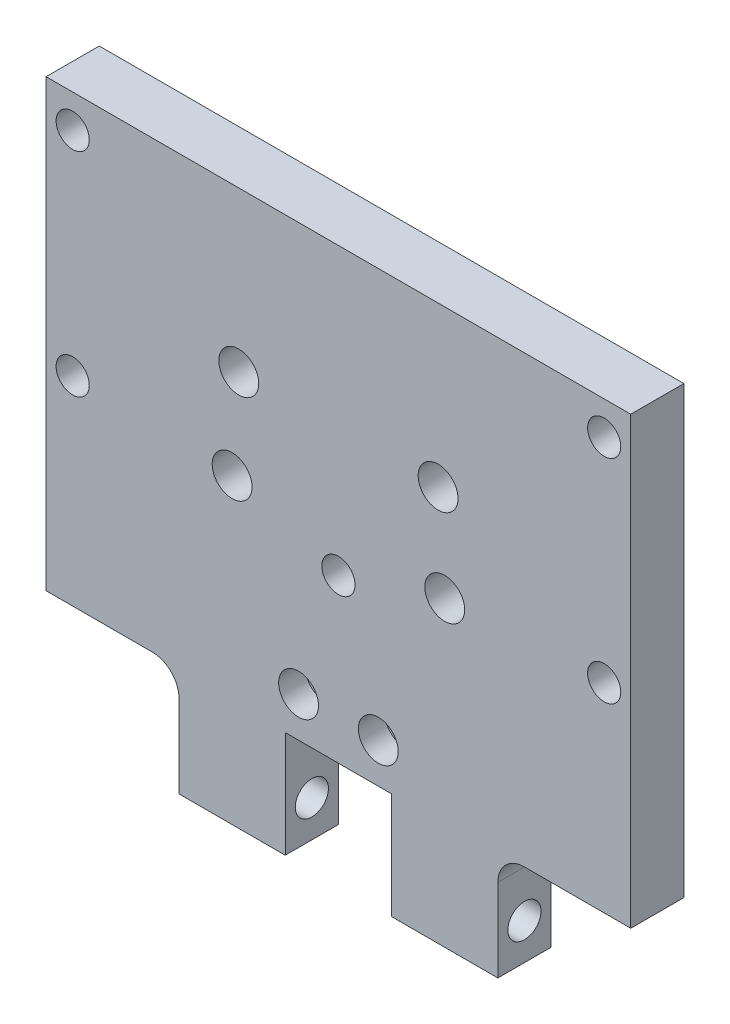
ISO-10303-21;
HEADER;
FILE_DESCRIPTION(('STEP AP214'),'2;1');
FILE_NAME('part.step','',(''),(''),'','','');
FILE_SCHEMA(('AUTOMOTIVE_DESIGN { 1 0 10303 214 1 1 1 1 }'));
ENDSEC;
DATA;
#1=APPLICATION_CONTEXT('core data for automotive mechanical design processes');
#2=APPLICATION_PROTOCOL_DEFINITION('international standard','automotive_design',2000,#1);
#3=PRODUCT_CONTEXT('',#1,'mechanical');
#4=PRODUCT('Part','Part','',(#3));
#5=PRODUCT_RELATED_PRODUCT_CATEGORY('part','',(#4));
#6=PRODUCT_DEFINITION_FORMATION('','',#4);
#7=PRODUCT_DEFINITION_CONTEXT('part definition',#1,'design');
#8=PRODUCT_DEFINITION('design','',#6,#7);
#9=PRODUCT_DEFINITION_SHAPE('','',#8);
#10=(LENGTH_UNIT() NAMED_UNIT(*) SI_UNIT(.MILLI.,.METRE.));
#11=(NAMED_UNIT(*) PLANE_ANGLE_UNIT() SI_UNIT($,.RADIAN.));
#12=(NAMED_UNIT(*) SI_UNIT($,.STERADIAN.) SOLID_ANGLE_UNIT());
#13=UNCERTAINTY_MEASURE_WITH_UNIT(LENGTH_MEASURE(1.E-05),#10,'distance_accuracy_value','');
#14=(GEOMETRIC_REPRESENTATION_CONTEXT(3) GLOBAL_UNCERTAINTY_ASSIGNED_CONTEXT((#13)) GLOBAL_UNIT_ASSIGNED_CONTEXT((#10,
#11,#12)) REPRESENTATION_CONTEXT('',''));
#15=CARTESIAN_POINT('',(0.,0.,0.));
#16=DIRECTION('',(0.,0.,1.));
#17=DIRECTION('',(1.,0.,0.));
#18=AXIS2_PLACEMENT_3D('',#15,#16,#17);
#19=CARTESIAN_POINT('',(0.,0.,6.35));
#20=DIRECTION('',(0.,0.,1.));
#21=DIRECTION('',(1.,0.,0.));
#22=AXIS2_PLACEMENT_3D('',#19,#20,#21);
#23=PLANE('',#22);
#24=CARTESIAN_POINT('',(-9.525,-59.5122,6.35));
#25=DIRECTION('',(0.,0.,1.));
#26=DIRECTION('',(1.,0.,0.));
#27=AXIS2_PLACEMENT_3D('',#24,#25,#26);
#28=CIRCLE('',#27,4.7625);
#29=CARTESIAN_POINT('',(-14.2875,-59.5122,6.35));
#30=VERTEX_POINT('',#29);
#31=EDGE_CURVE('E242',#30,#30,#28,.F.);
#32=ORIENTED_EDGE('',*,*,#31,.T.);
#33=EDGE_LOOP('',(#32));
#34=FACE_BOUND('',#33,.T.);
#35=CARTESIAN_POINT('',(0.,-30.1752,6.35));
#36=DIRECTION('',(0.,0.,1.));
#37=DIRECTION('',(1.,0.,0.));
#38=AXIS2_PLACEMENT_3D('',#35,#36,#37);
#39=CIRCLE('',#38,3.9624);
#40=CARTESIAN_POINT('',(3.9624,-30.1752,6.35));
#41=VERTEX_POINT('',#40);
#42=EDGE_CURVE('E288',#41,#41,#39,.T.);
#43=ORIENTED_EDGE('',*,*,#42,.F.);
#44=EDGE_LOOP('',(#43));
#45=FACE_BOUND('',#44,.T.);
#46=CARTESIAN_POINT('',(25.4,-22.225,6.35));
#47=DIRECTION('',(0.,0.,1.));
#48=DIRECTION('',(1.,0.,0.));
#49=AXIS2_PLACEMENT_3D('',#46,#47,#48);
#50=CIRCLE('',#49,4.7625);
#51=CARTESIAN_POINT('',(30.1625,-22.225,6.35));
#52=VERTEX_POINT('',#51);
#53=EDGE_CURVE('E292',#52,#52,#50,.T.);
#54=ORIENTED_EDGE('',*,*,#53,.F.);
#55=EDGE_LOOP('',(#54));
#56=FACE_BOUND('',#55,.T.);
#57=CARTESIAN_POINT('',(-25.4,-22.225,6.35));
#58=DIRECTION('',(0.,0.,1.));
#59=DIRECTION('',(1.,0.,0.));
#60=AXIS2_PLACEMENT_3D('',#57,#58,#59);
#61=CIRCLE('',#60,4.7625);
#62=CARTESIAN_POINT('',(-20.6375,-22.225,6.35));
#63=VERTEX_POINT('',#62);
#64=EDGE_CURVE('E298',#63,#63,#61,.T.);
#65=ORIENTED_EDGE('',*,*,#64,.F.);
#66=EDGE_LOOP('',(#65));
#67=FACE_BOUND('',#66,.T.);
#68=CARTESIAN_POINT('',(63.5,30.1752,6.35));
#69=DIRECTION('',(0.,0.,1.));
#70=DIRECTION('',(1.,0.,0.));
#71=AXIS2_PLACEMENT_3D('',#68,#69,#70);
#72=CIRCLE('',#71,3.96239999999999);
#73=CARTESIAN_POINT('',(67.4624,30.1752,6.35));
#74=VERTEX_POINT('',#73);
#75=EDGE_CURVE('E304',#74,#74,#72,.T.);
#76=ORIENTED_EDGE('',*,*,#75,.F.);
#77=EDGE_LOOP('',(#76));
#78=FACE_BOUND('',#77,.T.);
#79=CARTESIAN_POINT('',(63.5,-20.6248,6.35));
#80=DIRECTION('',(0.,0.,1.));
#81=DIRECTION('',(1.,0.,0.));
#82=AXIS2_PLACEMENT_3D('',#79,#80,#81);
#83=CIRCLE('',#82,3.96239999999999);
#84=CARTESIAN_POINT('',(67.4624,-20.6248,6.35));
#85=VERTEX_POINT('',#84);
#86=EDGE_CURVE('E310',#85,#85,#83,.T.);
#87=ORIENTED_EDGE('',*,*,#86,.F.);
#88=EDGE_LOOP('',(#87));
#89=FACE_BOUND('',#88,.T.);
#90=CARTESIAN_POINT('',(-63.5,30.1752,6.35));
#91=DIRECTION('',(0.,0.,1.));
#92=DIRECTION('',(1.,0.,0.));
#93=AXIS2_PLACEMENT_3D('',#90,#91,#92);
#94=CIRCLE('',#93,3.9624);
#95=CARTESIAN_POINT('',(-59.5376,30.1752,6.35));
#96=VERTEX_POINT('',#95);
#97=EDGE_CURVE('E316',#96,#96,#94,.T.);
#98=ORIENTED_EDGE('',*,*,#97,.F.);
#99=EDGE_LOOP('',(#98));
#100=FACE_BOUND('',#99,.T.);
#101=CARTESIAN_POINT('',(-63.5,-20.6248,6.35));
#102=DIRECTION('',(0.,0.,1.));
#103=DIRECTION('',(1.,0.,0.));
#104=AXIS2_PLACEMENT_3D('',#101,#102,#103);
#105=CIRCLE('',#104,3.9624);
#106=CARTESIAN_POINT('',(-59.5376,-20.6248,6.35));
#107=VERTEX_POINT('',#106);
#108=EDGE_CURVE('E322',#107,#107,#105,.T.);
#109=ORIENTED_EDGE('',*,*,#108,.F.);
#110=EDGE_LOOP('',(#109));
#111=FACE_BOUND('',#110,.T.);
#112=CARTESIAN_POINT('',(23.8125,0.,6.35));
#113=DIRECTION('',(0.,0.,1.));
#114=DIRECTION('',(1.,0.,0.));
#115=AXIS2_PLACEMENT_3D('',#112,#113,#114);
#116=CIRCLE('',#115,4.7625);
#117=CARTESIAN_POINT('',(28.575,0.,6.35));
#118=VERTEX_POINT('',#117);
#119=EDGE_CURVE('E328',#118,#118,#116,.T.);
#120=ORIENTED_EDGE('',*,*,#119,.F.);
#121=EDGE_LOOP('',(#120));
#122=FACE_BOUND('',#121,.T.);
#123=CARTESIAN_POINT('',(-23.8125,0.,6.35));
#124=DIRECTION('',(0.,0.,1.));
#125=DIRECTION('',(1.,0.,0.));
#126=AXIS2_PLACEMENT_3D('',#123,#124,#125);
#127=CIRCLE('',#126,4.7625);
#128=CARTESIAN_POINT('',(-19.05,0.,6.35));
#129=VERTEX_POINT('',#128);
#130=EDGE_CURVE('E165',#129,#129,#127,.T.);
#131=ORIENTED_EDGE('',*,*,#130,.F.);
#132=EDGE_LOOP('',(#131));
#133=FACE_BOUND('',#132,.T.);
#134=DIRECTION('',(0.,-1.,0.));
#135=VECTOR('',#134,1.);
#136=CARTESIAN_POINT('',(12.7,-94.4372,6.35));
#137=LINE('',#136,#135);
#138=CARTESIAN_POINT('',(12.7,-69.0372,6.35));
#139=VERTEX_POINT('',#138);
#140=CARTESIAN_POINT('',(12.7,-94.4372,6.35));
#141=VERTEX_POINT('',#140);
#142=EDGE_CURVE('E192',#139,#141,#137,.T.);
#143=ORIENTED_EDGE('',*,*,#142,.T.);
#144=DIRECTION('',(1.,0.,0.));
#145=VECTOR('',#144,1.);
#146=CARTESIAN_POINT('',(12.7,-94.4372,6.35));
#147=LINE('',#146,#145);
#148=CARTESIAN_POINT('',(38.1,-94.4372,6.35));
#149=VERTEX_POINT('',#148);
#150=EDGE_CURVE('E139',#141,#149,#147,.T.);
#151=ORIENTED_EDGE('',*,*,#150,.T.);
#152=DIRECTION('',(0.,1.,0.));
#153=VECTOR('',#152,1.);
#154=CARTESIAN_POINT('',(38.1,-94.4372,6.35));
#155=LINE('',#154,#153);
#156=CARTESIAN_POINT('',(38.1,-74.6252,6.35));
#157=VERTEX_POINT('',#156);
#158=EDGE_CURVE('E196',#149,#157,#155,.T.);
#159=ORIENTED_EDGE('',*,*,#158,.T.);
#160=CARTESIAN_POINT('',(44.45,-74.6252,6.35));
#161=DIRECTION('',(0.,0.,1.));
#162=DIRECTION('',(1.,0.,0.));
#163=AXIS2_PLACEMENT_3D('',#160,#161,#162);
#164=CIRCLE('',#163,6.35);
#165=CARTESIAN_POINT('',(44.45,-68.2752,6.35));
#166=VERTEX_POINT('',#165);
#167=EDGE_CURVE('E251',#157,#166,#164,.F.);
#168=ORIENTED_EDGE('',*,*,#167,.T.);
#169=DIRECTION('',(1.,0.,0.));
#170=VECTOR('',#169,1.);
#171=CARTESIAN_POINT('',(38.1,-68.2752,6.35));
#172=LINE('',#171,#170);
#173=CARTESIAN_POINT('',(69.85,-68.2752,6.35));
#174=VERTEX_POINT('',#173);
#175=EDGE_CURVE('E199',#166,#174,#172,.T.);
#176=ORIENTED_EDGE('',*,*,#175,.T.);
#177=DIRECTION('',(0.,1.,0.));
#178=VECTOR('',#177,1.);
#179=CARTESIAN_POINT('',(69.85,-68.2752,6.35));
#180=LINE('',#179,#178);
#181=CARTESIAN_POINT('',(69.85,38.1,6.35));
#182=VERTEX_POINT('',#181);
#183=EDGE_CURVE('E201',#174,#182,#180,.T.);
#184=ORIENTED_EDGE('',*,*,#183,.T.);
#185=DIRECTION('',(-1.,0.,0.));
#186=VECTOR('',#185,1.);
#187=CARTESIAN_POINT('',(69.85,38.1,6.35));
#188=LINE('',#187,#186);
#189=CARTESIAN_POINT('',(-69.85,38.1,6.35));
#190=VERTEX_POINT('',#189);
#191=EDGE_CURVE('E204',#182,#190,#188,.T.);
#192=ORIENTED_EDGE('',*,*,#191,.T.);
#193=DIRECTION('',(0.,-1.,0.));
#194=VECTOR('',#193,1.);
#195=CARTESIAN_POINT('',(-69.85,38.1,6.35));
#196=LINE('',#195,#194);
#197=CARTESIAN_POINT('',(-69.85,-68.2752,6.35));
#198=VERTEX_POINT('',#197);
#199=EDGE_CURVE('E207',#190,#198,#196,.T.);
#200=ORIENTED_EDGE('',*,*,#199,.T.);
#201=DIRECTION('',(1.,0.,0.));
#202=VECTOR('',#201,1.);
#203=CARTESIAN_POINT('',(-38.1,-68.2752,6.35));
#204=LINE('',#203,#202);
#205=CARTESIAN_POINT('',(-44.45,-68.2752,6.35));
#206=VERTEX_POINT('',#205);
#207=EDGE_CURVE('E210',#198,#206,#204,.T.);
#208=ORIENTED_EDGE('',*,*,#207,.T.);
#209=CARTESIAN_POINT('',(-44.45,-74.6252,6.35));
#210=DIRECTION('',(0.,0.,1.));
#211=DIRECTION('',(1.,0.,0.));
#212=AXIS2_PLACEMENT_3D('',#209,#210,#211);
#213=CIRCLE('',#212,6.35);
#214=CARTESIAN_POINT('',(-38.1,-74.6252,6.35));
#215=VERTEX_POINT('',#214);
#216=EDGE_CURVE('E42',#206,#215,#213,.F.);
#217=ORIENTED_EDGE('',*,*,#216,.T.);
#218=DIRECTION('',(0.,-1.,0.));
#219=VECTOR('',#218,1.);
#220=CARTESIAN_POINT('',(-38.1,-94.4372,6.35));
#221=LINE('',#220,#219);
#222=CARTESIAN_POINT('',(-38.1,-94.4372,6.35));
#223=VERTEX_POINT('',#222);
#224=EDGE_CURVE('E212',#215,#223,#221,.T.);
#225=ORIENTED_EDGE('',*,*,#224,.T.);
#226=DIRECTION('',(1.,0.,0.));
#227=VECTOR('',#226,1.);
#228=CARTESIAN_POINT('',(-38.1,-94.4372,6.35));
#229=LINE('',#228,#227);
#230=CARTESIAN_POINT('',(-12.7,-94.4372,6.35));
#231=VERTEX_POINT('',#230);
#232=EDGE_CURVE('E214',#223,#231,#229,.T.);
#233=ORIENTED_EDGE('',*,*,#232,.T.);
#234=DIRECTION('',(0.,1.,0.));
#235=VECTOR('',#234,1.);
#236=CARTESIAN_POINT('',(-12.7,-69.0372,6.35));
#237=LINE('',#236,#235);
#238=CARTESIAN_POINT('',(-12.7,-69.0372,6.35));
#239=VERTEX_POINT('',#238);
#240=EDGE_CURVE('E162',#231,#239,#237,.T.);
#241=ORIENTED_EDGE('',*,*,#240,.T.);
#242=DIRECTION('',(1.,0.,0.));
#243=VECTOR('',#242,1.);
#244=CARTESIAN_POINT('',(12.7,-69.0372,6.35));
#245=LINE('',#244,#243);
#246=EDGE_CURVE('E159',#239,#139,#245,.T.);
#247=ORIENTED_EDGE('',*,*,#246,.T.);
#248=EDGE_LOOP('',(#143,#151,#159,#168,#176,#184,#192,#200,#208,#217,#225,#233,#241,#247));
#249=FACE_BOUND('',#248,.T.);
#250=CARTESIAN_POINT('',(9.525,-59.5122,6.35));
#251=DIRECTION('',(0.,0.,1.));
#252=DIRECTION('',(1.,0.,0.));
#253=AXIS2_PLACEMENT_3D('',#250,#251,#252);
#254=CIRCLE('',#253,4.7625);
#255=CARTESIAN_POINT('',(4.7625,-59.5122,6.35));
#256=VERTEX_POINT('',#255);
#257=EDGE_CURVE('E37',#256,#256,#254,.F.);
#258=ORIENTED_EDGE('',*,*,#257,.T.);
#259=EDGE_LOOP('',(#258));
#260=FACE_BOUND('',#259,.T.);
#261=ADVANCED_FACE('F33',(#34,#45,#56,#67,#78,#89,#100,#111,#122,#133,#249,#260),#23,.T.);
#262=CARTESIAN_POINT('',(9.525,-59.5122,-6.35));
#263=DIRECTION('',(0.,0.,1.));
#264=DIRECTION('',(1.,0.,0.));
#265=AXIS2_PLACEMENT_3D('',#262,#263,#264);
#266=CYLINDRICAL_SURFACE('',#265,3.175);
#267=CARTESIAN_POINT('',(9.525,-59.5122,-6.35));
#268=DIRECTION('',(0.,0.,1.));
#269=DIRECTION('',(1.,0.,0.));
#270=AXIS2_PLACEMENT_3D('',#267,#268,#269);
#271=CIRCLE('',#270,3.175);
#272=CARTESIAN_POINT('',(12.7,-59.5122,-6.35));
#273=VERTEX_POINT('',#272);
#274=EDGE_CURVE('E282',#273,#273,#271,.T.);
#275=ORIENTED_EDGE('',*,*,#274,.F.);
#276=EDGE_LOOP('',(#275));
#277=FACE_BOUND('',#276,.T.);
#278=CARTESIAN_POINT('',(9.525,-59.5122,0.));
#279=DIRECTION('',(0.,0.,1.));
#280=DIRECTION('',(1.,0.,0.));
#281=AXIS2_PLACEMENT_3D('',#278,#279,#280);
#282=CIRCLE('',#281,3.175);
#283=CARTESIAN_POINT('',(12.7,-59.5122,0.));
#284=VERTEX_POINT('',#283);
#285=EDGE_CURVE('E261',#284,#284,#282,.F.);
#286=ORIENTED_EDGE('',*,*,#285,.F.);
#287=EDGE_LOOP('',(#286));
#288=FACE_BOUND('',#287,.T.);
#289=ADVANCED_FACE('F344',(#277,#288),#266,.F.);
#290=CARTESIAN_POINT('',(-9.525,-59.5122,-6.35));
#291=DIRECTION('',(0.,0.,1.));
#292=DIRECTION('',(1.,0.,0.));
#293=AXIS2_PLACEMENT_3D('',#290,#291,#292);
#294=CYLINDRICAL_SURFACE('',#293,3.175);
#295=CARTESIAN_POINT('',(-9.525,-59.5122,-6.35));
#296=DIRECTION('',(0.,0.,1.));
#297=DIRECTION('',(1.,0.,0.));
#298=AXIS2_PLACEMENT_3D('',#295,#296,#297);
#299=CIRCLE('',#298,3.175);
#300=CARTESIAN_POINT('',(-6.35,-59.5122,-6.35));
#301=VERTEX_POINT('',#300);
#302=EDGE_CURVE('E285',#301,#301,#299,.T.);
#303=ORIENTED_EDGE('',*,*,#302,.F.);
#304=EDGE_LOOP('',(#303));
#305=FACE_BOUND('',#304,.T.);
#306=CARTESIAN_POINT('',(-9.525,-59.5122,0.));
#307=DIRECTION('',(0.,0.,1.));
#308=DIRECTION('',(1.,0.,0.));
#309=AXIS2_PLACEMENT_3D('',#306,#307,#308);
#310=CIRCLE('',#309,3.175);
#311=CARTESIAN_POINT('',(-6.35,-59.5122,0.));
#312=VERTEX_POINT('',#311);
#313=EDGE_CURVE('E256',#312,#312,#310,.F.);
#314=ORIENTED_EDGE('',*,*,#313,.F.);
#315=EDGE_LOOP('',(#314));
#316=FACE_BOUND('',#315,.T.);
#317=ADVANCED_FACE('F376',(#305,#316),#294,.F.);
#318=CARTESIAN_POINT('',(12.7,-94.4372,-6.35));
#319=DIRECTION('',(-1.,0.,0.));
#320=DIRECTION('',(0.,-1.,0.));
#321=AXIS2_PLACEMENT_3D('',#318,#319,#320);
#322=PLANE('',#321);
#323=CARTESIAN_POINT('',(12.7,-85.725,0.));
#324=DIRECTION('',(-1.,0.,0.));
#325=DIRECTION('',(0.,-1.,0.));
#326=AXIS2_PLACEMENT_3D('',#323,#324,#325);
#327=CIRCLE('',#326,3.9624);
#328=CARTESIAN_POINT('',(12.7,-89.6874,0.));
#329=VERTEX_POINT('',#328);
#330=EDGE_CURVE('E279',#329,#329,#327,.T.);
#331=ORIENTED_EDGE('',*,*,#330,.F.);
#332=EDGE_LOOP('',(#331));
#333=FACE_BOUND('',#332,.T.);
#334=ORIENTED_EDGE('',*,*,#142,.F.);
#335=DIRECTION('',(0.,0.,1.));
#336=VECTOR('',#335,1.);
#337=CARTESIAN_POINT('',(12.7,-69.0372,-6.35));
#338=LINE('',#337,#336);
#339=CARTESIAN_POINT('',(12.7,-69.0372,-6.35));
#340=VERTEX_POINT('',#339);
#341=EDGE_CURVE('E158',#340,#139,#338,.T.);
#342=ORIENTED_EDGE('',*,*,#341,.F.);
#343=DIRECTION('',(0.,-1.,0.));
#344=VECTOR('',#343,1.);
#345=CARTESIAN_POINT('',(12.7,-94.4372,-6.35));
#346=LINE('',#345,#344);
#347=CARTESIAN_POINT('',(12.7,-94.4372,-6.35));
#348=VERTEX_POINT('',#347);
#349=EDGE_CURVE('E152',#340,#348,#346,.T.);
#350=ORIENTED_EDGE('',*,*,#349,.T.);
#351=DIRECTION('',(0.,0.,1.));
#352=VECTOR('',#351,1.);
#353=CARTESIAN_POINT('',(12.7,-94.4372,-6.35));
#354=LINE('',#353,#352);
#355=EDGE_CURVE('E134',#348,#141,#354,.T.);
#356=ORIENTED_EDGE('',*,*,#355,.T.);
#357=EDGE_LOOP('',(#334,#342,#350,#356));
#358=FACE_BOUND('',#357,.T.);
#359=ADVANCED_FACE('F157',(#333,#358),#322,.T.);
#360=CARTESIAN_POINT('',(12.7,-69.0372,-6.35));
#361=DIRECTION('',(0.,-1.,0.));
#362=DIRECTION('',(0.,0.,-1.));
#363=AXIS2_PLACEMENT_3D('',#360,#361,#362);
#364=PLANE('',#363);
#365=ORIENTED_EDGE('',*,*,#246,.F.);
#366=DIRECTION('',(0.,0.,1.));
#367=VECTOR('',#366,1.);
#368=CARTESIAN_POINT('',(-12.7,-69.0372,-6.35));
#369=LINE('',#368,#367);
#370=CARTESIAN_POINT('',(-12.7,-69.0372,-6.35));
#371=VERTEX_POINT('',#370);
#372=EDGE_CURVE('E221',#371,#239,#369,.T.);
#373=ORIENTED_EDGE('',*,*,#372,.F.);
#374=DIRECTION('',(1.,0.,0.));
#375=VECTOR('',#374,1.);
#376=CARTESIAN_POINT('',(12.7,-69.0372,-6.35));
#377=LINE('',#376,#375);
#378=EDGE_CURVE('E145',#371,#340,#377,.T.);
#379=ORIENTED_EDGE('',*,*,#378,.T.);
#380=ORIENTED_EDGE('',*,*,#341,.T.);
#381=EDGE_LOOP('',(#365,#373,#379,#380));
#382=FACE_BOUND('',#381,.T.);
#383=ADVANCED_FACE('F419',(#382),#364,.T.);
#384=CARTESIAN_POINT('',(-12.7,-69.0372,-6.35));
#385=DIRECTION('',(1.,0.,0.));
#386=DIRECTION('',(0.,1.,0.));
#387=AXIS2_PLACEMENT_3D('',#384,#385,#386);
#388=PLANE('',#387);
#389=CARTESIAN_POINT('',(-12.7,-85.725,0.));
#390=DIRECTION('',(1.,0.,0.));
#391=DIRECTION('',(0.,1.,0.));
#392=AXIS2_PLACEMENT_3D('',#389,#390,#391);
#393=CIRCLE('',#392,3.9624);
#394=CARTESIAN_POINT('',(-12.7,-81.7626,0.));
#395=VERTEX_POINT('',#394);
#396=EDGE_CURVE('E276',#395,#395,#393,.T.);
#397=ORIENTED_EDGE('',*,*,#396,.F.);
#398=EDGE_LOOP('',(#397));
#399=FACE_BOUND('',#398,.T.);
#400=ORIENTED_EDGE('',*,*,#240,.F.);
#401=DIRECTION('',(0.,0.,1.));
#402=VECTOR('',#401,1.);
#403=CARTESIAN_POINT('',(-12.7,-94.4372,-6.35));
#404=LINE('',#403,#402);
#405=CARTESIAN_POINT('',(-12.7,-94.4372,-6.35));
#406=VERTEX_POINT('',#405);
#407=EDGE_CURVE('E223',#406,#231,#404,.T.);
#408=ORIENTED_EDGE('',*,*,#407,.F.);
#409=DIRECTION('',(0.,1.,0.));
#410=VECTOR('',#409,1.);
#411=CARTESIAN_POINT('',(-12.7,-69.0372,-6.35));
#412=LINE('',#411,#410);
#413=EDGE_CURVE('E188',#406,#371,#412,.T.);
#414=ORIENTED_EDGE('',*,*,#413,.T.);
#415=ORIENTED_EDGE('',*,*,#372,.T.);
#416=EDGE_LOOP('',(#400,#408,#414,#415));
#417=FACE_BOUND('',#416,.T.);
#418=ADVANCED_FACE('F422',(#399,#417),#388,.T.);
#419=CARTESIAN_POINT('',(-38.1,-94.4372,-6.35));
#420=DIRECTION('',(0.,-1.,0.));
#421=DIRECTION('',(0.,0.,-1.));
#422=AXIS2_PLACEMENT_3D('',#419,#420,#421);
#423=PLANE('',#422);
#424=ORIENTED_EDGE('',*,*,#232,.F.);
#425=DIRECTION('',(0.,0.,1.));
#426=VECTOR('',#425,1.);
#427=CARTESIAN_POINT('',(-38.1,-94.4372,-6.35));
#428=LINE('',#427,#426);
#429=CARTESIAN_POINT('',(-38.1,-94.4372,-6.35));
#430=VERTEX_POINT('',#429);
#431=EDGE_CURVE('E225',#430,#223,#428,.T.);
#432=ORIENTED_EDGE('',*,*,#431,.F.);
#433=DIRECTION('',(1.,0.,0.));
#434=VECTOR('',#433,1.);
#435=CARTESIAN_POINT('',(-38.1,-94.4372,-6.35));
#436=LINE('',#435,#434);
#437=EDGE_CURVE('E185',#430,#406,#436,.T.);
#438=ORIENTED_EDGE('',*,*,#437,.T.);
#439=ORIENTED_EDGE('',*,*,#407,.T.);
#440=EDGE_LOOP('',(#424,#432,#438,#439));
#441=FACE_BOUND('',#440,.T.);
#442=ADVANCED_FACE('F426',(#441),#423,.T.);
#443=CARTESIAN_POINT('',(-38.1,-94.4372,-6.35));
#444=DIRECTION('',(-1.,0.,0.));
#445=DIRECTION('',(0.,0.,1.));
#446=AXIS2_PLACEMENT_3D('',#443,#444,#445);
#447=PLANE('',#446);
#448=CARTESIAN_POINT('',(-38.1,-85.725,0.));
#449=DIRECTION('',(-1.,0.,0.));
#450=DIRECTION('',(0.,0.,1.));
#451=AXIS2_PLACEMENT_3D('',#448,#449,#450);
#452=CIRCLE('',#451,3.9624);
#453=CARTESIAN_POINT('',(-38.1,-85.725,3.9624));
#454=VERTEX_POINT('',#453);
#455=EDGE_CURVE('E241',#454,#454,#452,.T.);
#456=ORIENTED_EDGE('',*,*,#455,.F.);
#457=EDGE_LOOP('',(#456));
#458=FACE_BOUND('',#457,.T.);
#459=ORIENTED_EDGE('',*,*,#224,.F.);
#460=DIRECTION('',(0.,0.,1.));
#461=VECTOR('',#460,1.);
#462=CARTESIAN_POINT('',(-38.1,-74.6252,-6.35));
#463=LINE('',#462,#461);
#464=CARTESIAN_POINT('',(-38.1,-74.6252,-6.35));
#465=VERTEX_POINT('',#464);
#466=EDGE_CURVE('E50',#215,#465,#463,.F.);
#467=ORIENTED_EDGE('',*,*,#466,.T.);
#468=DIRECTION('',(0.,-1.,0.));
#469=VECTOR('',#468,1.);
#470=CARTESIAN_POINT('',(-38.1,-94.4372,-6.35));
#471=LINE('',#470,#469);
#472=EDGE_CURVE('E183',#465,#430,#471,.T.);
#473=ORIENTED_EDGE('',*,*,#472,.T.);
#474=ORIENTED_EDGE('',*,*,#431,.T.);
#475=EDGE_LOOP('',(#459,#467,#473,#474));
#476=FACE_BOUND('',#475,.T.);
#477=ADVANCED_FACE('F430',(#458,#476),#447,.T.);
#478=CARTESIAN_POINT('',(-38.1,-68.2752,-6.35));
#479=DIRECTION('',(0.,-1.,0.));
#480=DIRECTION('',(0.,0.,-1.));
#481=AXIS2_PLACEMENT_3D('',#478,#479,#480);
#482=PLANE('',#481);
#483=DIRECTION('',(1.,0.,0.));
#484=VECTOR('',#483,1.);
#485=CARTESIAN_POINT('',(-38.1,-68.2752,-6.35));
#486=LINE('',#485,#484);
#487=CARTESIAN_POINT('',(-69.85,-68.2752,-6.35));
#488=VERTEX_POINT('',#487);
#489=CARTESIAN_POINT('',(-44.45,-68.2752,-6.35));
#490=VERTEX_POINT('',#489);
#491=EDGE_CURVE('E180',#488,#490,#486,.T.);
#492=ORIENTED_EDGE('',*,*,#491,.T.);
#493=DIRECTION('',(0.,0.,1.));
#494=VECTOR('',#493,1.);
#495=CARTESIAN_POINT('',(-44.45,-68.2752,6.35));
#496=LINE('',#495,#494);
#497=EDGE_CURVE('E247',#490,#206,#496,.T.);
#498=ORIENTED_EDGE('',*,*,#497,.T.);
#499=ORIENTED_EDGE('',*,*,#207,.F.);
#500=DIRECTION('',(0.,0.,1.));
#501=VECTOR('',#500,1.);
#502=CARTESIAN_POINT('',(-69.85,-68.2752,-6.35));
#503=LINE('',#502,#501);
#504=EDGE_CURVE('E228',#488,#198,#503,.T.);
#505=ORIENTED_EDGE('',*,*,#504,.F.);
#506=EDGE_LOOP('',(#492,#498,#499,#505));
#507=FACE_BOUND('',#506,.T.);
#508=ADVANCED_FACE('F434',(#507),#482,.T.);
#509=CARTESIAN_POINT('',(-69.85,38.1,-6.35));
#510=DIRECTION('',(-1.,0.,0.));
#511=DIRECTION('',(0.,0.,1.));
#512=AXIS2_PLACEMENT_3D('',#509,#510,#511);
#513=PLANE('',#512);
#514=ORIENTED_EDGE('',*,*,#199,.F.);
#515=DIRECTION('',(0.,0.,1.));
#516=VECTOR('',#515,1.);
#517=CARTESIAN_POINT('',(-69.85,38.1,-6.35));
#518=LINE('',#517,#516);
#519=CARTESIAN_POINT('',(-69.85,38.1,-6.35));
#520=VERTEX_POINT('',#519);
#521=EDGE_CURVE('E230',#520,#190,#518,.T.);
#522=ORIENTED_EDGE('',*,*,#521,.F.);
#523=DIRECTION('',(0.,-1.,0.));
#524=VECTOR('',#523,1.);
#525=CARTESIAN_POINT('',(-69.85,38.1,-6.35));
#526=LINE('',#525,#524);
#527=EDGE_CURVE('E177',#520,#488,#526,.T.);
#528=ORIENTED_EDGE('',*,*,#527,.T.);
#529=ORIENTED_EDGE('',*,*,#504,.T.);
#530=EDGE_LOOP('',(#514,#522,#528,#529));
#531=FACE_BOUND('',#530,.T.);
#532=ADVANCED_FACE('F438',(#531),#513,.T.);
#533=CARTESIAN_POINT('',(69.85,38.1,-6.35));
#534=DIRECTION('',(0.,1.,0.));
#535=DIRECTION('',(0.,0.,1.));
#536=AXIS2_PLACEMENT_3D('',#533,#534,#535);
#537=PLANE('',#536);
#538=ORIENTED_EDGE('',*,*,#191,.F.);
#539=DIRECTION('',(0.,0.,1.));
#540=VECTOR('',#539,1.);
#541=CARTESIAN_POINT('',(69.85,38.1,-6.35));
#542=LINE('',#541,#540);
#543=CARTESIAN_POINT('',(69.85,38.1,-6.35));
#544=VERTEX_POINT('',#543);
#545=EDGE_CURVE('E232',#544,#182,#542,.T.);
#546=ORIENTED_EDGE('',*,*,#545,.F.);
#547=DIRECTION('',(-1.,0.,0.));
#548=VECTOR('',#547,1.);
#549=CARTESIAN_POINT('',(69.85,38.1,-6.35));
#550=LINE('',#549,#548);
#551=EDGE_CURVE('E174',#544,#520,#550,.T.);
#552=ORIENTED_EDGE('',*,*,#551,.T.);
#553=ORIENTED_EDGE('',*,*,#521,.T.);
#554=EDGE_LOOP('',(#538,#546,#552,#553));
#555=FACE_BOUND('',#554,.T.);
#556=ADVANCED_FACE('F442',(#555),#537,.T.);
#557=CARTESIAN_POINT('',(69.85,-68.2752,-6.35));
#558=DIRECTION('',(1.,0.,0.));
#559=DIRECTION('',(0.,1.,0.));
#560=AXIS2_PLACEMENT_3D('',#557,#558,#559);
#561=PLANE('',#560);
#562=ORIENTED_EDGE('',*,*,#183,.F.);
#563=DIRECTION('',(0.,0.,1.));
#564=VECTOR('',#563,1.);
#565=CARTESIAN_POINT('',(69.85,-68.2752,-6.35));
#566=LINE('',#565,#564);
#567=CARTESIAN_POINT('',(69.85,-68.2752,-6.35));
#568=VERTEX_POINT('',#567);
#569=EDGE_CURVE('E234',#568,#174,#566,.T.);
#570=ORIENTED_EDGE('',*,*,#569,.F.);
#571=DIRECTION('',(0.,1.,0.));
#572=VECTOR('',#571,1.);
#573=CARTESIAN_POINT('',(69.85,-68.2752,-6.35));
#574=LINE('',#573,#572);
#575=EDGE_CURVE('E171',#568,#544,#574,.T.);
#576=ORIENTED_EDGE('',*,*,#575,.T.);
#577=ORIENTED_EDGE('',*,*,#545,.T.);
#578=EDGE_LOOP('',(#562,#570,#576,#577));
#579=FACE_BOUND('',#578,.T.);
#580=ADVANCED_FACE('F446',(#579),#561,.T.);
#581=CARTESIAN_POINT('',(38.1,-68.2752,-6.35));
#582=DIRECTION('',(0.,-1.,0.));
#583=DIRECTION('',(0.,0.,-1.));
#584=AXIS2_PLACEMENT_3D('',#581,#582,#583);
#585=PLANE('',#584);
#586=ORIENTED_EDGE('',*,*,#175,.F.);
#587=DIRECTION('',(0.,0.,1.));
#588=VECTOR('',#587,1.);
#589=CARTESIAN_POINT('',(44.45,-68.2752,-6.35));
#590=LINE('',#589,#588);
#591=CARTESIAN_POINT('',(44.45,-68.2752,-6.35));
#592=VERTEX_POINT('',#591);
#593=EDGE_CURVE('E245',#166,#592,#590,.F.);
#594=ORIENTED_EDGE('',*,*,#593,.T.);
#595=DIRECTION('',(1.,0.,0.));
#596=VECTOR('',#595,1.);
#597=CARTESIAN_POINT('',(38.1,-68.2752,-6.35));
#598=LINE('',#597,#596);
#599=EDGE_CURVE('E169',#592,#568,#598,.T.);
#600=ORIENTED_EDGE('',*,*,#599,.T.);
#601=ORIENTED_EDGE('',*,*,#569,.T.);
#602=EDGE_LOOP('',(#586,#594,#600,#601));
#603=FACE_BOUND('',#602,.T.);
#604=ADVANCED_FACE('F450',(#603),#585,.T.);
#605=CARTESIAN_POINT('',(38.1,-94.4372,-6.35));
#606=DIRECTION('',(1.,0.,0.));
#607=DIRECTION('',(0.,0.,-1.));
#608=AXIS2_PLACEMENT_3D('',#605,#606,#607);
#609=PLANE('',#608);
#610=CARTESIAN_POINT('',(38.1,-85.725,0.));
#611=DIRECTION('',(1.,0.,0.));
#612=DIRECTION('',(0.,0.,-1.));
#613=AXIS2_PLACEMENT_3D('',#610,#611,#612);
#614=CIRCLE('',#613,3.9624);
#615=CARTESIAN_POINT('',(38.1,-85.725,-3.9624));
#616=VERTEX_POINT('',#615);
#617=EDGE_CURVE('E238',#616,#616,#614,.T.);
#618=ORIENTED_EDGE('',*,*,#617,.F.);
#619=EDGE_LOOP('',(#618));
#620=FACE_BOUND('',#619,.T.);
#621=DIRECTION('',(0.,1.,0.));
#622=VECTOR('',#621,1.);
#623=CARTESIAN_POINT('',(38.1,-94.4372,-6.35));
#624=LINE('',#623,#622);
#625=CARTESIAN_POINT('',(38.1,-94.4372,-6.35));
#626=VERTEX_POINT('',#625);
#627=CARTESIAN_POINT('',(38.1,-74.6252,-6.35));
#628=VERTEX_POINT('',#627);
#629=EDGE_CURVE('E155',#626,#628,#624,.T.);
#630=ORIENTED_EDGE('',*,*,#629,.T.);
#631=DIRECTION('',(0.,0.,1.));
#632=VECTOR('',#631,1.);
#633=CARTESIAN_POINT('',(38.1,-74.6252,6.35));
#634=LINE('',#633,#632);
#635=EDGE_CURVE('E220',#628,#157,#634,.T.);
#636=ORIENTED_EDGE('',*,*,#635,.T.);
#637=ORIENTED_EDGE('',*,*,#158,.F.);
#638=DIRECTION('',(0.,0.,1.));
#639=VECTOR('',#638,1.);
#640=CARTESIAN_POINT('',(38.1,-94.4372,-6.35));
#641=LINE('',#640,#639);
#642=EDGE_CURVE('E144',#626,#149,#641,.T.);
#643=ORIENTED_EDGE('',*,*,#642,.F.);
#644=EDGE_LOOP('',(#630,#636,#637,#643));
#645=FACE_BOUND('',#644,.T.);
#646=ADVANCED_FACE('F454',(#620,#645),#609,.T.);
#647=CARTESIAN_POINT('',(12.7,-94.4372,-6.35));
#648=DIRECTION('',(0.,-1.,0.));
#649=DIRECTION('',(0.,0.,-1.));
#650=AXIS2_PLACEMENT_3D('',#647,#648,#649);
#651=PLANE('',#650);
#652=ORIENTED_EDGE('',*,*,#150,.F.);
#653=ORIENTED_EDGE('',*,*,#355,.F.);
#654=DIRECTION('',(1.,0.,0.));
#655=VECTOR('',#654,1.);
#656=CARTESIAN_POINT('',(12.7,-94.4372,-6.35));
#657=LINE('',#656,#655);
#658=EDGE_CURVE('E137',#348,#626,#657,.T.);
#659=ORIENTED_EDGE('',*,*,#658,.T.);
#660=ORIENTED_EDGE('',*,*,#642,.T.);
#661=EDGE_LOOP('',(#652,#653,#659,#660));
#662=FACE_BOUND('',#661,.T.);
#663=ADVANCED_FACE('F136',(#662),#651,.T.);
#664=CARTESIAN_POINT('',(0.,0.,-6.35));
#665=DIRECTION('',(0.,0.,1.));
#666=DIRECTION('',(1.,0.,0.));
#667=AXIS2_PLACEMENT_3D('',#664,#665,#666);
#668=PLANE('',#667);
#669=ORIENTED_EDGE('',*,*,#274,.T.);
#670=EDGE_LOOP('',(#669));
#671=FACE_BOUND('',#670,.T.);
#672=ORIENTED_EDGE('',*,*,#302,.T.);
#673=EDGE_LOOP('',(#672));
#674=FACE_BOUND('',#673,.T.);
#675=CARTESIAN_POINT('',(0.,-30.1752,-6.35));
#676=DIRECTION('',(0.,0.,1.));
#677=DIRECTION('',(1.,0.,0.));
#678=AXIS2_PLACEMENT_3D('',#675,#676,#677);
#679=CIRCLE('',#678,3.9624);
#680=CARTESIAN_POINT('',(3.9624,-30.1752,-6.35));
#681=VERTEX_POINT('',#680);
#682=EDGE_CURVE('E289',#681,#681,#679,.T.);
#683=ORIENTED_EDGE('',*,*,#682,.T.);
#684=EDGE_LOOP('',(#683));
#685=FACE_BOUND('',#684,.T.);
#686=CARTESIAN_POINT('',(25.4,-22.225,-6.35));
#687=DIRECTION('',(0.,0.,1.));
#688=DIRECTION('',(1.,0.,0.));
#689=AXIS2_PLACEMENT_3D('',#686,#687,#688);
#690=CIRCLE('',#689,4.7625);
#691=CARTESIAN_POINT('',(30.1625,-22.225,-6.35));
#692=VERTEX_POINT('',#691);
#693=EDGE_CURVE('E295',#692,#692,#690,.T.);
#694=ORIENTED_EDGE('',*,*,#693,.T.);
#695=EDGE_LOOP('',(#694));
#696=FACE_BOUND('',#695,.T.);
#697=CARTESIAN_POINT('',(-25.4,-22.225,-6.35));
#698=DIRECTION('',(0.,0.,1.));
#699=DIRECTION('',(1.,0.,0.));
#700=AXIS2_PLACEMENT_3D('',#697,#698,#699);
#701=CIRCLE('',#700,4.7625);
#702=CARTESIAN_POINT('',(-20.6375,-22.225,-6.35));
#703=VERTEX_POINT('',#702);
#704=EDGE_CURVE('E301',#703,#703,#701,.T.);
#705=ORIENTED_EDGE('',*,*,#704,.T.);
#706=EDGE_LOOP('',(#705));
#707=FACE_BOUND('',#706,.T.);
#708=CARTESIAN_POINT('',(63.5,30.1752,-6.35));
#709=DIRECTION('',(0.,0.,1.));
#710=DIRECTION('',(1.,0.,0.));
#711=AXIS2_PLACEMENT_3D('',#708,#709,#710);
#712=CIRCLE('',#711,3.96239999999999);
#713=CARTESIAN_POINT('',(67.4624,30.1752,-6.35));
#714=VERTEX_POINT('',#713);
#715=EDGE_CURVE('E307',#714,#714,#712,.T.);
#716=ORIENTED_EDGE('',*,*,#715,.T.);
#717=EDGE_LOOP('',(#716));
#718=FACE_BOUND('',#717,.T.);
#719=CARTESIAN_POINT('',(63.5,-20.6248,-6.35));
#720=DIRECTION('',(0.,0.,1.));
#721=DIRECTION('',(1.,0.,0.));
#722=AXIS2_PLACEMENT_3D('',#719,#720,#721);
#723=CIRCLE('',#722,3.96239999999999);
#724=CARTESIAN_POINT('',(67.4624,-20.6248,-6.35));
#725=VERTEX_POINT('',#724);
#726=EDGE_CURVE('E313',#725,#725,#723,.T.);
#727=ORIENTED_EDGE('',*,*,#726,.T.);
#728=EDGE_LOOP('',(#727));
#729=FACE_BOUND('',#728,.T.);
#730=CARTESIAN_POINT('',(-63.5,30.1752,-6.35));
#731=DIRECTION('',(0.,0.,1.));
#732=DIRECTION('',(1.,0.,0.));
#733=AXIS2_PLACEMENT_3D('',#730,#731,#732);
#734=CIRCLE('',#733,3.9624);
#735=CARTESIAN_POINT('',(-59.5376,30.1752,-6.35));
#736=VERTEX_POINT('',#735);
#737=EDGE_CURVE('E319',#736,#736,#734,.T.);
#738=ORIENTED_EDGE('',*,*,#737,.T.);
#739=EDGE_LOOP('',(#738));
#740=FACE_BOUND('',#739,.T.);
#741=CARTESIAN_POINT('',(-63.5,-20.6248,-6.35));
#742=DIRECTION('',(0.,0.,1.));
#743=DIRECTION('',(1.,0.,0.));
#744=AXIS2_PLACEMENT_3D('',#741,#742,#743);
#745=CIRCLE('',#744,3.9624);
#746=CARTESIAN_POINT('',(-59.5376,-20.6248,-6.35));
#747=VERTEX_POINT('',#746);
#748=EDGE_CURVE('E325',#747,#747,#745,.T.);
#749=ORIENTED_EDGE('',*,*,#748,.T.);
#750=EDGE_LOOP('',(#749));
#751=FACE_BOUND('',#750,.T.);
#752=CARTESIAN_POINT('',(23.8125,0.,-6.35));
#753=DIRECTION('',(0.,0.,1.));
#754=DIRECTION('',(1.,0.,0.));
#755=AXIS2_PLACEMENT_3D('',#752,#753,#754);
#756=CIRCLE('',#755,4.7625);
#757=CARTESIAN_POINT('',(28.575,0.,-6.35));
#758=VERTEX_POINT('',#757);
#759=EDGE_CURVE('E331',#758,#758,#756,.T.);
#760=ORIENTED_EDGE('',*,*,#759,.T.);
#761=EDGE_LOOP('',(#760));
#762=FACE_BOUND('',#761,.T.);
#763=CARTESIAN_POINT('',(-23.8125,0.,-6.35));
#764=DIRECTION('',(0.,0.,1.));
#765=DIRECTION('',(1.,0.,0.));
#766=AXIS2_PLACEMENT_3D('',#763,#764,#765);
#767=CIRCLE('',#766,4.7625);
#768=CARTESIAN_POINT('',(-19.05,0.,-6.35));
#769=VERTEX_POINT('',#768);
#770=EDGE_CURVE('E194',#769,#769,#767,.T.);
#771=ORIENTED_EDGE('',*,*,#770,.T.);
#772=EDGE_LOOP('',(#771));
#773=FACE_BOUND('',#772,.T.);
#774=ORIENTED_EDGE('',*,*,#349,.F.);
#775=ORIENTED_EDGE('',*,*,#378,.F.);
#776=ORIENTED_EDGE('',*,*,#413,.F.);
#777=ORIENTED_EDGE('',*,*,#437,.F.);
#778=ORIENTED_EDGE('',*,*,#472,.F.);
#779=CARTESIAN_POINT('',(-44.45,-74.6252,-6.35));
#780=DIRECTION('',(0.,0.,1.));
#781=DIRECTION('',(1.,0.,0.));
#782=AXIS2_PLACEMENT_3D('',#779,#780,#781);
#783=CIRCLE('',#782,6.35);
#784=EDGE_CURVE('E11',#465,#490,#783,.T.);
#785=ORIENTED_EDGE('',*,*,#784,.T.);
#786=ORIENTED_EDGE('',*,*,#491,.F.);
#787=ORIENTED_EDGE('',*,*,#527,.F.);
#788=ORIENTED_EDGE('',*,*,#551,.F.);
#789=ORIENTED_EDGE('',*,*,#575,.F.);
#790=ORIENTED_EDGE('',*,*,#599,.F.);
#791=CARTESIAN_POINT('',(44.45,-74.6252,-6.35));
#792=DIRECTION('',(0.,0.,1.));
#793=DIRECTION('',(1.,0.,0.));
#794=AXIS2_PLACEMENT_3D('',#791,#792,#793);
#795=CIRCLE('',#794,6.35);
#796=EDGE_CURVE('E253',#592,#628,#795,.T.);
#797=ORIENTED_EDGE('',*,*,#796,.T.);
#798=ORIENTED_EDGE('',*,*,#629,.F.);
#799=ORIENTED_EDGE('',*,*,#658,.F.);
#800=EDGE_LOOP('',(#774,#775,#776,#777,#778,#785,#786,#787,#788,#789,#790,#797,#798,#799));
#801=FACE_BOUND('',#800,.T.);
#802=ADVANCED_FACE('F150',(#671,#674,#685,#696,#707,#718,#729,#740,#751,#762,#773,#801),#668,.F.);
#803=CARTESIAN_POINT('',(-23.8125,0.,-6.35));
#804=DIRECTION('',(0.,0.,1.));
#805=DIRECTION('',(1.,0.,0.));
#806=AXIS2_PLACEMENT_3D('',#803,#804,#805);
#807=CYLINDRICAL_SURFACE('',#806,4.7625);
#808=ORIENTED_EDGE('',*,*,#770,.F.);
#809=EDGE_LOOP('',(#808));
#810=FACE_BOUND('',#809,.T.);
#811=ORIENTED_EDGE('',*,*,#130,.T.);
#812=EDGE_LOOP('',(#811));
#813=FACE_BOUND('',#812,.T.);
#814=ADVANCED_FACE('F341',(#810,#813),#807,.F.);
#815=CARTESIAN_POINT('',(23.8125,0.,-6.35));
#816=DIRECTION('',(0.,0.,1.));
#817=DIRECTION('',(1.,0.,0.));
#818=AXIS2_PLACEMENT_3D('',#815,#816,#817);
#819=CYLINDRICAL_SURFACE('',#818,4.7625);
#820=ORIENTED_EDGE('',*,*,#759,.F.);
#821=EDGE_LOOP('',(#820));
#822=FACE_BOUND('',#821,.T.);
#823=ORIENTED_EDGE('',*,*,#119,.T.);
#824=EDGE_LOOP('',(#823));
#825=FACE_BOUND('',#824,.T.);
#826=ADVANCED_FACE('F408',(#822,#825),#819,.F.);
#827=CARTESIAN_POINT('',(-63.5,-20.6248,-6.35));
#828=DIRECTION('',(0.,0.,1.));
#829=DIRECTION('',(1.,0.,0.));
#830=AXIS2_PLACEMENT_3D('',#827,#828,#829);
#831=CYLINDRICAL_SURFACE('',#830,3.9624);
#832=ORIENTED_EDGE('',*,*,#748,.F.);
#833=EDGE_LOOP('',(#832));
#834=FACE_BOUND('',#833,.T.);
#835=ORIENTED_EDGE('',*,*,#108,.T.);
#836=EDGE_LOOP('',(#835));
#837=FACE_BOUND('',#836,.T.);
#838=ADVANCED_FACE('F404',(#834,#837),#831,.F.);
#839=CARTESIAN_POINT('',(-63.5,30.1752,-6.35));
#840=DIRECTION('',(0.,0.,1.));
#841=DIRECTION('',(1.,0.,0.));
#842=AXIS2_PLACEMENT_3D('',#839,#840,#841);
#843=CYLINDRICAL_SURFACE('',#842,3.9624);
#844=ORIENTED_EDGE('',*,*,#737,.F.);
#845=EDGE_LOOP('',(#844));
#846=FACE_BOUND('',#845,.T.);
#847=ORIENTED_EDGE('',*,*,#97,.T.);
#848=EDGE_LOOP('',(#847));
#849=FACE_BOUND('',#848,.T.);
#850=ADVANCED_FACE('F400',(#846,#849),#843,.F.);
#851=CARTESIAN_POINT('',(63.5,-20.6248,-6.35));
#852=DIRECTION('',(0.,0.,1.));
#853=DIRECTION('',(1.,0.,0.));
#854=AXIS2_PLACEMENT_3D('',#851,#852,#853);
#855=CYLINDRICAL_SURFACE('',#854,3.96239999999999);
#856=ORIENTED_EDGE('',*,*,#726,.F.);
#857=EDGE_LOOP('',(#856));
#858=FACE_BOUND('',#857,.T.);
#859=ORIENTED_EDGE('',*,*,#86,.T.);
#860=EDGE_LOOP('',(#859));
#861=FACE_BOUND('',#860,.T.);
#862=ADVANCED_FACE('F396',(#858,#861),#855,.F.);
#863=CARTESIAN_POINT('',(63.5,30.1752,-6.35));
#864=DIRECTION('',(0.,0.,1.));
#865=DIRECTION('',(1.,0.,0.));
#866=AXIS2_PLACEMENT_3D('',#863,#864,#865);
#867=CYLINDRICAL_SURFACE('',#866,3.96239999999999);
#868=ORIENTED_EDGE('',*,*,#715,.F.);
#869=EDGE_LOOP('',(#868));
#870=FACE_BOUND('',#869,.T.);
#871=ORIENTED_EDGE('',*,*,#75,.T.);
#872=EDGE_LOOP('',(#871));
#873=FACE_BOUND('',#872,.T.);
#874=ADVANCED_FACE('F392',(#870,#873),#867,.F.);
#875=CARTESIAN_POINT('',(-25.4,-22.225,-6.35));
#876=DIRECTION('',(0.,0.,1.));
#877=DIRECTION('',(1.,0.,0.));
#878=AXIS2_PLACEMENT_3D('',#875,#876,#877);
#879=CYLINDRICAL_SURFACE('',#878,4.7625);
#880=ORIENTED_EDGE('',*,*,#704,.F.);
#881=EDGE_LOOP('',(#880));
#882=FACE_BOUND('',#881,.T.);
#883=ORIENTED_EDGE('',*,*,#64,.T.);
#884=EDGE_LOOP('',(#883));
#885=FACE_BOUND('',#884,.T.);
#886=ADVANCED_FACE('F388',(#882,#885),#879,.F.);
#887=CARTESIAN_POINT('',(25.4,-22.225,-6.35));
#888=DIRECTION('',(0.,0.,1.));
#889=DIRECTION('',(1.,0.,0.));
#890=AXIS2_PLACEMENT_3D('',#887,#888,#889);
#891=CYLINDRICAL_SURFACE('',#890,4.7625);
#892=ORIENTED_EDGE('',*,*,#693,.F.);
#893=EDGE_LOOP('',(#892));
#894=FACE_BOUND('',#893,.T.);
#895=ORIENTED_EDGE('',*,*,#53,.T.);
#896=EDGE_LOOP('',(#895));
#897=FACE_BOUND('',#896,.T.);
#898=ADVANCED_FACE('F384',(#894,#897),#891,.F.);
#899=CARTESIAN_POINT('',(0.,-30.1752,-6.35));
#900=DIRECTION('',(0.,0.,1.));
#901=DIRECTION('',(1.,0.,0.));
#902=AXIS2_PLACEMENT_3D('',#899,#900,#901);
#903=CYLINDRICAL_SURFACE('',#902,3.9624);
#904=ORIENTED_EDGE('',*,*,#682,.F.);
#905=EDGE_LOOP('',(#904));
#906=FACE_BOUND('',#905,.T.);
#907=ORIENTED_EDGE('',*,*,#42,.T.);
#908=EDGE_LOOP('',(#907));
#909=FACE_BOUND('',#908,.T.);
#910=ADVANCED_FACE('F381',(#906,#909),#903,.F.);
#911=CARTESIAN_POINT('',(-101.6,-85.725,0.));
#912=DIRECTION('',(1.,0.,0.));
#913=DIRECTION('',(0.,0.,-1.));
#914=AXIS2_PLACEMENT_3D('',#911,#912,#913);
#915=CYLINDRICAL_SURFACE('',#914,3.9624);
#916=ORIENTED_EDGE('',*,*,#330,.T.);
#917=EDGE_LOOP('',(#916));
#918=FACE_BOUND('',#917,.T.);
#919=ORIENTED_EDGE('',*,*,#617,.T.);
#920=EDGE_LOOP('',(#919));
#921=FACE_BOUND('',#920,.T.);
#922=ADVANCED_FACE('F372',(#918,#921),#915,.F.);
#923=ORIENTED_EDGE('',*,*,#396,.T.);
#924=EDGE_LOOP('',(#923));
#925=FACE_BOUND('',#924,.T.);
#926=ORIENTED_EDGE('',*,*,#455,.T.);
#927=EDGE_LOOP('',(#926));
#928=FACE_BOUND('',#927,.T.);
#929=ADVANCED_FACE('F368',(#925,#928),#915,.F.);
#930=CARTESIAN_POINT('',(44.45,-74.6252,-6.35));
#931=DIRECTION('',(0.,0.,-1.));
#932=DIRECTION('',(-1.,0.,0.));
#933=AXIS2_PLACEMENT_3D('',#930,#931,#932);
#934=CYLINDRICAL_SURFACE('',#933,6.35);
#935=ORIENTED_EDGE('',*,*,#796,.F.);
#936=ORIENTED_EDGE('',*,*,#593,.F.);
#937=ORIENTED_EDGE('',*,*,#167,.F.);
#938=ORIENTED_EDGE('',*,*,#635,.F.);
#939=EDGE_LOOP('',(#935,#936,#937,#938));
#940=FACE_BOUND('',#939,.T.);
#941=ADVANCED_FACE('F371',(#940),#934,.F.);
#942=CARTESIAN_POINT('',(-44.45,-74.6252,-6.35));
#943=DIRECTION('',(0.,0.,-1.));
#944=DIRECTION('',(-1.,0.,0.));
#945=AXIS2_PLACEMENT_3D('',#942,#943,#944);
#946=CYLINDRICAL_SURFACE('',#945,6.35);
#947=ORIENTED_EDGE('',*,*,#784,.F.);
#948=ORIENTED_EDGE('',*,*,#466,.F.);
#949=ORIENTED_EDGE('',*,*,#216,.F.);
#950=ORIENTED_EDGE('',*,*,#497,.F.);
#951=EDGE_LOOP('',(#947,#948,#949,#950));
#952=FACE_BOUND('',#951,.T.);
#953=ADVANCED_FACE('F35',(#952),#946,.F.);
#954=CARTESIAN_POINT('',(-9.525,-59.5122,0.));
#955=DIRECTION('',(0.,0.,1.));
#956=DIRECTION('',(1.,0.,0.));
#957=AXIS2_PLACEMENT_3D('',#954,#955,#956);
#958=PLANE('',#957);
#959=CARTESIAN_POINT('',(-9.525,-59.5122,0.));
#960=DIRECTION('',(0.,0.,1.));
#961=DIRECTION('',(1.,0.,0.));
#962=AXIS2_PLACEMENT_3D('',#959,#960,#961);
#963=CIRCLE('',#962,4.7625);
#964=CARTESIAN_POINT('',(-14.2875,-59.5122,0.));
#965=VERTEX_POINT('',#964);
#966=EDGE_CURVE('E259',#965,#965,#963,.T.);
#967=ORIENTED_EDGE('',*,*,#966,.T.);
#968=EDGE_LOOP('',(#967));
#969=FACE_BOUND('',#968,.T.);
#970=ORIENTED_EDGE('',*,*,#313,.T.);
#971=EDGE_LOOP('',(#970));
#972=FACE_BOUND('',#971,.T.);
#973=ADVANCED_FACE('F361',(#969,#972),#958,.T.);
#974=CARTESIAN_POINT('',(-9.525,-59.5122,7.62));
#975=DIRECTION('',(0.,0.,-1.));
#976=DIRECTION('',(-1.,0.,0.));
#977=AXIS2_PLACEMENT_3D('',#974,#975,#976);
#978=CYLINDRICAL_SURFACE('',#977,4.7625);
#979=CARTESIAN_POINT('',(-14.2875,-59.5122,6.35));
#980=CARTESIAN_POINT('',(-14.2875,-59.5122,6.28385416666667));
#981=CARTESIAN_POINT('',(-14.2875,-59.5122,6.21770833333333));
#982=CARTESIAN_POINT('',(-14.2875,-59.5122,6.08541666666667));
#983=CARTESIAN_POINT('',(-14.2875,-59.5122,6.01927083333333));
#984=CARTESIAN_POINT('',(-14.2875,-59.5122,5.88697916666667));
#985=CARTESIAN_POINT('',(-14.2875,-59.5122,5.82083333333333));
#986=CARTESIAN_POINT('',(-14.2875,-59.5122,5.68854166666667));
#987=CARTESIAN_POINT('',(-14.2875,-59.5122,5.62239583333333));
#988=CARTESIAN_POINT('',(-14.2875,-59.5122,5.49010416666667));
#989=CARTESIAN_POINT('',(-14.2875,-59.5122,5.42395833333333));
#990=CARTESIAN_POINT('',(-14.2875,-59.5122,5.29166666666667));
#991=CARTESIAN_POINT('',(-14.2875,-59.5122,5.22552083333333));
#992=CARTESIAN_POINT('',(-14.2875,-59.5122,5.09322916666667));
#993=CARTESIAN_POINT('',(-14.2875,-59.5122,5.02708333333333));
#994=CARTESIAN_POINT('',(-14.2875,-59.5122,4.89479166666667));
#995=CARTESIAN_POINT('',(-14.2875,-59.5122,4.82864583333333));
#996=CARTESIAN_POINT('',(-14.2875,-59.5122,4.69635416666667));
#997=CARTESIAN_POINT('',(-14.2875,-59.5122,4.63020833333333));
#998=CARTESIAN_POINT('',(-14.2875,-59.5122,4.49791666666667));
#999=CARTESIAN_POINT('',(-14.2875,-59.5122,4.43177083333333));
#1000=CARTESIAN_POINT('',(-14.2875,-59.5122,4.29947916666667));
#1001=CARTESIAN_POINT('',(-14.2875,-59.5122,4.23333333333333));
#1002=CARTESIAN_POINT('',(-14.2875,-59.5122,4.10104166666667));
#1003=CARTESIAN_POINT('',(-14.2875,-59.5122,4.03489583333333));
#1004=CARTESIAN_POINT('',(-14.2875,-59.5122,3.90260416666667));
#1005=CARTESIAN_POINT('',(-14.2875,-59.5122,3.83645833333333));
#1006=CARTESIAN_POINT('',(-14.2875,-59.5122,3.70416666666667));
#1007=CARTESIAN_POINT('',(-14.2875,-59.5122,3.63802083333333));
#1008=CARTESIAN_POINT('',(-14.2875,-59.5122,3.50572916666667));
#1009=CARTESIAN_POINT('',(-14.2875,-59.5122,3.43958333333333));
#1010=CARTESIAN_POINT('',(-14.2875,-59.5122,3.30729166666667));
#1011=CARTESIAN_POINT('',(-14.2875,-59.5122,3.24114583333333));
#1012=CARTESIAN_POINT('',(-14.2875,-59.5122,3.10885416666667));
#1013=CARTESIAN_POINT('',(-14.2875,-59.5122,3.04270833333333));
#1014=CARTESIAN_POINT('',(-14.2875,-59.5122,2.91041666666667));
#1015=CARTESIAN_POINT('',(-14.2875,-59.5122,2.84427083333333));
#1016=CARTESIAN_POINT('',(-14.2875,-59.5122,2.71197916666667));
#1017=CARTESIAN_POINT('',(-14.2875,-59.5122,2.64583333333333));
#1018=CARTESIAN_POINT('',(-14.2875,-59.5122,2.51354166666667));
#1019=CARTESIAN_POINT('',(-14.2875,-59.5122,2.44739583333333));
#1020=CARTESIAN_POINT('',(-14.2875,-59.5122,2.31510416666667));
#1021=CARTESIAN_POINT('',(-14.2875,-59.5122,2.24895833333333));
#1022=CARTESIAN_POINT('',(-14.2875,-59.5122,2.11666666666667));
#1023=CARTESIAN_POINT('',(-14.2875,-59.5122,2.05052083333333));
#1024=CARTESIAN_POINT('',(-14.2875,-59.5122,1.91822916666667));
#1025=CARTESIAN_POINT('',(-14.2875,-59.5122,1.85208333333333));
#1026=CARTESIAN_POINT('',(-14.2875,-59.5122,1.71979166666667));
#1027=CARTESIAN_POINT('',(-14.2875,-59.5122,1.65364583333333));
#1028=CARTESIAN_POINT('',(-14.2875,-59.5122,1.52135416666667));
#1029=CARTESIAN_POINT('',(-14.2875,-59.5122,1.45520833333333));
#1030=CARTESIAN_POINT('',(-14.2875,-59.5122,1.32291666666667));
#1031=CARTESIAN_POINT('',(-14.2875,-59.5122,1.25677083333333));
#1032=CARTESIAN_POINT('',(-14.2875,-59.5122,1.12447916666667));
#1033=CARTESIAN_POINT('',(-14.2875,-59.5122,1.05833333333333));
#1034=CARTESIAN_POINT('',(-14.2875,-59.5122,0.926041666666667));
#1035=CARTESIAN_POINT('',(-14.2875,-59.5122,0.859895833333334));
#1036=CARTESIAN_POINT('',(-14.2875,-59.5122,0.727604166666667));
#1037=CARTESIAN_POINT('',(-14.2875,-59.5122,0.661458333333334));
#1038=CARTESIAN_POINT('',(-14.2875,-59.5122,0.529166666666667));
#1039=CARTESIAN_POINT('',(-14.2875,-59.5122,0.463020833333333));
#1040=CARTESIAN_POINT('',(-14.2875,-59.5122,0.330729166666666));
#1041=CARTESIAN_POINT('',(-14.2875,-59.5122,0.264583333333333));
#1042=CARTESIAN_POINT('',(-14.2875,-59.5122,0.132291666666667));
#1043=CARTESIAN_POINT('',(-14.2875,-59.5122,0.0661458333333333));
#1044=CARTESIAN_POINT('',(-14.2875,-59.5122,0.));
#1045=B_SPLINE_CURVE_WITH_KNOTS('',3,(#979,#980,#981,#982,#983,#984,#985,#986,#987,#988,#989,
#990,#991,#992,#993,#994,#995,#996,#997,#998,#999,#1000,#1001,#1002,#1003,#1004,#1005,#1006,
#1007,#1008,#1009,#1010,#1011,#1012,#1013,#1014,#1015,#1016,#1017,#1018,#1019,#1020,#1021,#1022,
#1023,#1024,#1025,#1026,#1027,#1028,#1029,#1030,#1031,#1032,#1033,#1034,#1035,#1036,#1037,#1038,
#1039,#1040,#1041,#1042,#1043,#1044),.UNSPECIFIED.,.F.,.F.,(4,2,2,2,2,2,2,2,2,2,2,2,2,2,2,2,2,2,
2,2,2,2,2,2,2,2,2,2,2,2,2,2,4),(0.,0.1984375,0.396875,0.595312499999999,0.79375,
0.992187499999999,1.190625,1.3890625,1.5875,1.7859375,1.984375,2.1828125,2.38125,2.5796875,
2.778125,2.9765625,3.175,3.3734375,3.571875,3.7703125,3.96875,4.1671875,4.365625,4.5640625,
4.7625,4.9609375,5.159375,5.3578125,5.55625,5.7546875,5.953125,6.1515625,6.35),.UNSPECIFIED.);
#1046=EDGE_CURVE('BSEAM358',#30,#965,#1045,.T.);
#1047=ORIENTED_EDGE('',*,*,#31,.F.);
#1048=ORIENTED_EDGE('',*,*,#966,.F.);
#1049=ORIENTED_EDGE('',*,*,#1046,.T.);
#1050=ORIENTED_EDGE('',*,*,#1046,.F.);
#1051=EDGE_LOOP('',(#1047,#1049,#1048,#1050));
#1052=FACE_BOUND('',#1051,.T.);
#1053=ADVANCED_FACE('F358',(#1052),#978,.F.);
#1054=CARTESIAN_POINT('',(9.525,-59.5122,0.));
#1055=DIRECTION('',(0.,0.,1.));
#1056=DIRECTION('',(1.,0.,0.));
#1057=AXIS2_PLACEMENT_3D('',#1054,#1055,#1056);
#1058=PLANE('',#1057);
#1059=CARTESIAN_POINT('',(9.525,-59.5122,0.));
#1060=DIRECTION('',(0.,0.,1.));
#1061=DIRECTION('',(1.,0.,0.));
#1062=AXIS2_PLACEMENT_3D('',#1059,#1060,#1061);
#1063=CIRCLE('',#1062,4.7625);
#1064=CARTESIAN_POINT('',(4.7625,-59.5122,0.));
#1065=VERTEX_POINT('',#1064);
#1066=EDGE_CURVE('E263',#1065,#1065,#1063,.T.);
#1067=ORIENTED_EDGE('',*,*,#1066,.T.);
#1068=EDGE_LOOP('',(#1067));
#1069=FACE_BOUND('',#1068,.T.);
#1070=ORIENTED_EDGE('',*,*,#285,.T.);
#1071=EDGE_LOOP('',(#1070));
#1072=FACE_BOUND('',#1071,.T.);
#1073=ADVANCED_FACE('F353',(#1069,#1072),#1058,.T.);
#1074=CARTESIAN_POINT('',(9.525,-59.5122,7.62));
#1075=DIRECTION('',(0.,0.,-1.));
#1076=DIRECTION('',(-1.,0.,0.));
#1077=AXIS2_PLACEMENT_3D('',#1074,#1075,#1076);
#1078=CYLINDRICAL_SURFACE('',#1077,4.7625);
#1079=CARTESIAN_POINT('',(4.7625,-59.5122,6.35));
#1080=CARTESIAN_POINT('',(4.7625,-59.5122,6.28385416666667));
#1081=CARTESIAN_POINT('',(4.7625,-59.5122,6.21770833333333));
#1082=CARTESIAN_POINT('',(4.7625,-59.5122,6.08541666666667));
#1083=CARTESIAN_POINT('',(4.7625,-59.5122,6.01927083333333));
#1084=CARTESIAN_POINT('',(4.7625,-59.5122,5.88697916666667));
#1085=CARTESIAN_POINT('',(4.7625,-59.5122,5.82083333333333));
#1086=CARTESIAN_POINT('',(4.7625,-59.5122,5.68854166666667));
#1087=CARTESIAN_POINT('',(4.7625,-59.5122,5.62239583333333));
#1088=CARTESIAN_POINT('',(4.7625,-59.5122,5.49010416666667));
#1089=CARTESIAN_POINT('',(4.7625,-59.5122,5.42395833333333));
#1090=CARTESIAN_POINT('',(4.7625,-59.5122,5.29166666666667));
#1091=CARTESIAN_POINT('',(4.7625,-59.5122,5.22552083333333));
#1092=CARTESIAN_POINT('',(4.7625,-59.5122,5.09322916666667));
#1093=CARTESIAN_POINT('',(4.7625,-59.5122,5.02708333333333));
#1094=CARTESIAN_POINT('',(4.7625,-59.5122,4.89479166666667));
#1095=CARTESIAN_POINT('',(4.7625,-59.5122,4.82864583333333));
#1096=CARTESIAN_POINT('',(4.7625,-59.5122,4.69635416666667));
#1097=CARTESIAN_POINT('',(4.7625,-59.5122,4.63020833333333));
#1098=CARTESIAN_POINT('',(4.7625,-59.5122,4.49791666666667));
#1099=CARTESIAN_POINT('',(4.7625,-59.5122,4.43177083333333));
#1100=CARTESIAN_POINT('',(4.7625,-59.5122,4.29947916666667));
#1101=CARTESIAN_POINT('',(4.7625,-59.5122,4.23333333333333));
#1102=CARTESIAN_POINT('',(4.7625,-59.5122,4.10104166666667));
#1103=CARTESIAN_POINT('',(4.7625,-59.5122,4.03489583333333));
#1104=CARTESIAN_POINT('',(4.7625,-59.5122,3.90260416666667));
#1105=CARTESIAN_POINT('',(4.7625,-59.5122,3.83645833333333));
#1106=CARTESIAN_POINT('',(4.7625,-59.5122,3.70416666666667));
#1107=CARTESIAN_POINT('',(4.7625,-59.5122,3.63802083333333));
#1108=CARTESIAN_POINT('',(4.7625,-59.5122,3.50572916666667));
#1109=CARTESIAN_POINT('',(4.7625,-59.5122,3.43958333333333));
#1110=CARTESIAN_POINT('',(4.7625,-59.5122,3.30729166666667));
#1111=CARTESIAN_POINT('',(4.7625,-59.5122,3.24114583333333));
#1112=CARTESIAN_POINT('',(4.7625,-59.5122,3.10885416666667));
#1113=CARTESIAN_POINT('',(4.7625,-59.5122,3.04270833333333));
#1114=CARTESIAN_POINT('',(4.7625,-59.5122,2.91041666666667));
#1115=CARTESIAN_POINT('',(4.7625,-59.5122,2.84427083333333));
#1116=CARTESIAN_POINT('',(4.7625,-59.5122,2.71197916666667));
#1117=CARTESIAN_POINT('',(4.7625,-59.5122,2.64583333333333));
#1118=CARTESIAN_POINT('',(4.7625,-59.5122,2.51354166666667));
#1119=CARTESIAN_POINT('',(4.7625,-59.5122,2.44739583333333));
#1120=CARTESIAN_POINT('',(4.7625,-59.5122,2.31510416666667));
#1121=CARTESIAN_POINT('',(4.7625,-59.5122,2.24895833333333));
#1122=CARTESIAN_POINT('',(4.7625,-59.5122,2.11666666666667));
#1123=CARTESIAN_POINT('',(4.7625,-59.5122,2.05052083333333));
#1124=CARTESIAN_POINT('',(4.7625,-59.5122,1.91822916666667));
#1125=CARTESIAN_POINT('',(4.7625,-59.5122,1.85208333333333));
#1126=CARTESIAN_POINT('',(4.7625,-59.5122,1.71979166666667));
#1127=CARTESIAN_POINT('',(4.7625,-59.5122,1.65364583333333));
#1128=CARTESIAN_POINT('',(4.7625,-59.5122,1.52135416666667));
#1129=CARTESIAN_POINT('',(4.7625,-59.5122,1.45520833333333));
#1130=CARTESIAN_POINT('',(4.7625,-59.5122,1.32291666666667));
#1131=CARTESIAN_POINT('',(4.7625,-59.5122,1.25677083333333));
#1132=CARTESIAN_POINT('',(4.7625,-59.5122,1.12447916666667));
#1133=CARTESIAN_POINT('',(4.7625,-59.5122,1.05833333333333));
#1134=CARTESIAN_POINT('',(4.7625,-59.5122,0.926041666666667));
#1135=CARTESIAN_POINT('',(4.7625,-59.5122,0.859895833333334));
#1136=CARTESIAN_POINT('',(4.7625,-59.5122,0.727604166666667));
#1137=CARTESIAN_POINT('',(4.7625,-59.5122,0.661458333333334));
#1138=CARTESIAN_POINT('',(4.7625,-59.5122,0.529166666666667));
#1139=CARTESIAN_POINT('',(4.7625,-59.5122,0.463020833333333));
#1140=CARTESIAN_POINT('',(4.7625,-59.5122,0.330729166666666));
#1141=CARTESIAN_POINT('',(4.7625,-59.5122,0.264583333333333));
#1142=CARTESIAN_POINT('',(4.7625,-59.5122,0.132291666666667));
#1143=CARTESIAN_POINT('',(4.7625,-59.5122,0.0661458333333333));
#1144=CARTESIAN_POINT('',(4.7625,-59.5122,0.));
#1145=B_SPLINE_CURVE_WITH_KNOTS('',3,(#1079,#1080,#1081,#1082,#1083,#1084,#1085,#1086,#1087,
#1088,#1089,#1090,#1091,#1092,#1093,#1094,#1095,#1096,#1097,#1098,#1099,#1100,#1101,#1102,#1103,
#1104,#1105,#1106,#1107,#1108,#1109,#1110,#1111,#1112,#1113,#1114,#1115,#1116,#1117,#1118,#1119,
#1120,#1121,#1122,#1123,#1124,#1125,#1126,#1127,#1128,#1129,#1130,#1131,#1132,#1133,#1134,#1135,
#1136,#1137,#1138,#1139,#1140,#1141,#1142,#1143,#1144),.UNSPECIFIED.,.F.,.F.,(4,2,2,2,2,2,2,2,2,
2,2,2,2,2,2,2,2,2,2,2,2,2,2,2,2,2,2,2,2,2,2,2,4),(0.,0.1984375,0.396875,0.595312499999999,
0.79375,0.992187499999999,1.190625,1.3890625,1.5875,1.7859375,1.984375,2.1828125,2.38125,
2.5796875,2.778125,2.9765625,3.175,3.3734375,3.571875,3.7703125,3.96875,4.1671875,4.365625,
4.5640625,4.7625,4.9609375,5.159375,5.3578125,5.55625,5.7546875,5.953125,6.1515625,6.35),.UNSPECIFIED.);
#1146=EDGE_CURVE('BSEAM350',#256,#1065,#1145,.T.);
#1147=ORIENTED_EDGE('',*,*,#257,.F.);
#1148=ORIENTED_EDGE('',*,*,#1066,.F.);
#1149=ORIENTED_EDGE('',*,*,#1146,.T.);
#1150=ORIENTED_EDGE('',*,*,#1146,.F.);
#1151=EDGE_LOOP('',(#1147,#1149,#1148,#1150));
#1152=FACE_BOUND('',#1151,.T.);
#1153=ADVANCED_FACE('F350',(#1152),#1078,.F.);
#1154=CLOSED_SHELL('',(#261,#289,#317,#359,#383,#418,#442,#477,#508,#532,#556,#580,#604,#646,
#663,#802,#814,#826,#838,#850,#862,#874,#886,#898,#910,#922,#929,#941,#953,#973,#1053,#1073,#1153));
#1155=MANIFOLD_SOLID_BREP('B2',#1154);
#1156=ADVANCED_BREP_SHAPE_REPRESENTATION('',(#18,#1155),#14);
#1157=SHAPE_DEFINITION_REPRESENTATION(#9,#1156);
ENDSEC;
END-ISO-10303-21;
